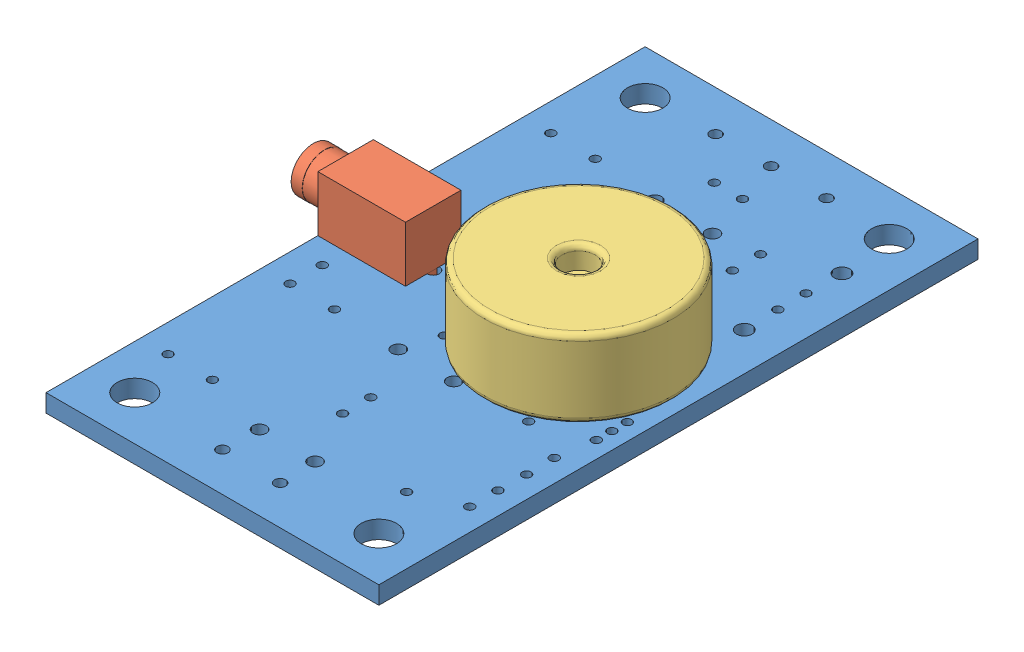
SolidWorks assembly Carte Buzzer.SLDASM, configuration Défaut (file format 4400). Lengths in mm.
Overall size (32.91 11 54).
4 component instances, 3 part files, 2 mates.
Components (placement in the parent):
- CI-AP-MLBP avec jack-1: CI-AP-MLBP avec jack.SLDASM [Défaut] at (2.0862 -1.3723 0) size (32.91 8.01 54)
  - CI BP et DEL-1: CI BP et DEL.SLDPRT [Défaut] at (-14.8869 -1.2382 0) size (30 1.6 54)
  - Embase jack 2.5-1: Embase jack 2.5.SLDPRT [Défaut] at (-14.8868 0.3618 -27.0002) size (10.81 8.01 5)
- BUZZER D17-1: BUZZER D17.SLDPRT [Default] at (7.699 -1.0105 -27.5003) x (-0.00013 0 -1) z (0 1 0) size (17 17 11)
Mates (geometry in assembly coordinates):
- Coïncidente6: coincident anti-aligned: axis of CI-AP-MLBP avec jack-1/CI BP et DEL-1 through (7.6997 -1.0105 -22.4003) axis (0 -1 0); axis of BUZZER D17-1 through (7.6997 -5.0105 -22.4003) axis (0 1 0)
- Coïncidente8: coincident anti-aligned: plane of CI-AP-MLBP avec jack-1/CI BP et DEL-1 through (-12.8007 -1.0105 -54) normal (0 1 0); plane of BUZZER D17-1 through (7.699 -1.0105 -27.5003) normal (0 -1 0)
